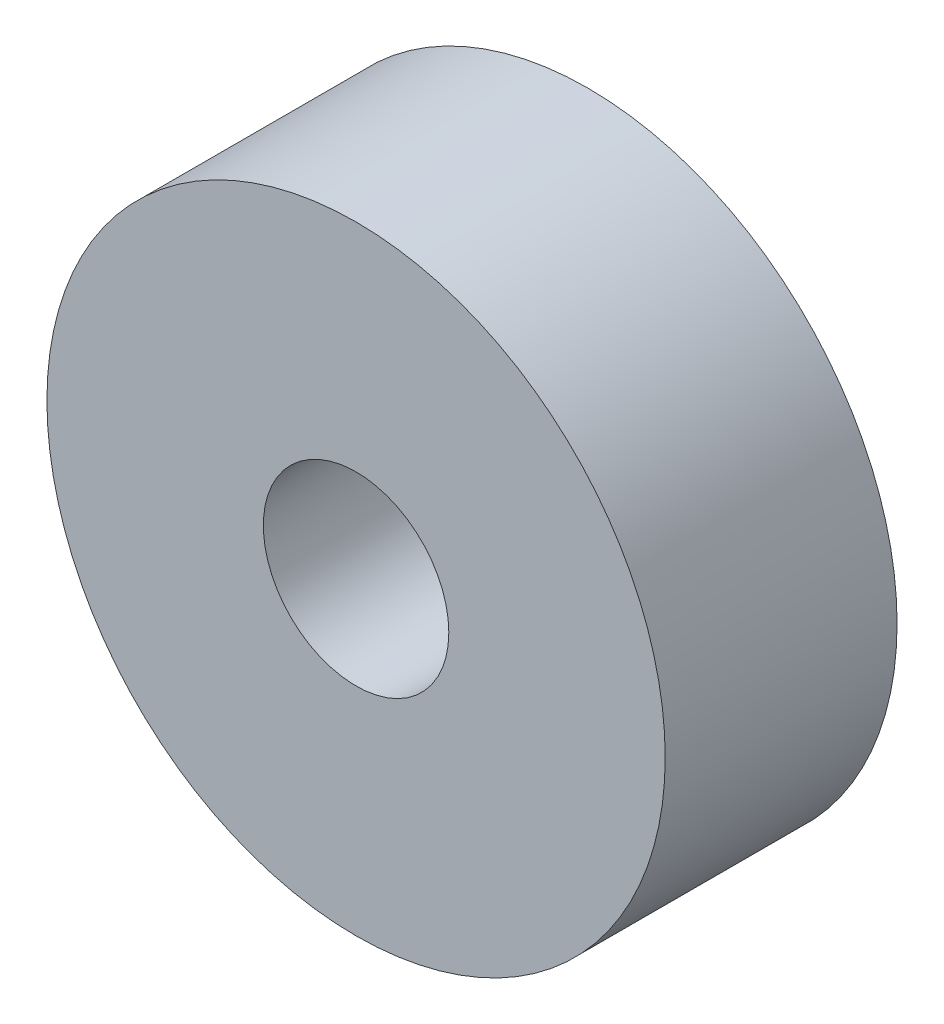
ISO-10303-21;
HEADER;
FILE_DESCRIPTION(('STEP AP214'),'2;1');
FILE_NAME('part.step','',(''),(''),'','','');
FILE_SCHEMA(('AUTOMOTIVE_DESIGN { 1 0 10303 214 1 1 1 1 }'));
ENDSEC;
DATA;
#1=APPLICATION_CONTEXT('core data for automotive mechanical design processes');
#2=APPLICATION_PROTOCOL_DEFINITION('international standard','automotive_design',2000,#1);
#3=PRODUCT_CONTEXT('',#1,'mechanical');
#4=PRODUCT('Part','Part','',(#3));
#5=PRODUCT_RELATED_PRODUCT_CATEGORY('part','',(#4));
#6=PRODUCT_DEFINITION_FORMATION('','',#4);
#7=PRODUCT_DEFINITION_CONTEXT('part definition',#1,'design');
#8=PRODUCT_DEFINITION('design','',#6,#7);
#9=PRODUCT_DEFINITION_SHAPE('','',#8);
#10=(LENGTH_UNIT() NAMED_UNIT(*) SI_UNIT(.MILLI.,.METRE.));
#11=(NAMED_UNIT(*) PLANE_ANGLE_UNIT() SI_UNIT($,.RADIAN.));
#12=(NAMED_UNIT(*) SI_UNIT($,.STERADIAN.) SOLID_ANGLE_UNIT());
#13=UNCERTAINTY_MEASURE_WITH_UNIT(LENGTH_MEASURE(1.E-05),#10,'distance_accuracy_value','');
#14=(GEOMETRIC_REPRESENTATION_CONTEXT(3) GLOBAL_UNCERTAINTY_ASSIGNED_CONTEXT((#13)) GLOBAL_UNIT_ASSIGNED_CONTEXT((#10,
#11,#12)) REPRESENTATION_CONTEXT('',''));
#15=CARTESIAN_POINT('',(0.,0.,0.));
#16=DIRECTION('',(0.,0.,1.));
#17=DIRECTION('',(1.,0.,0.));
#18=AXIS2_PLACEMENT_3D('',#15,#16,#17);
#19=CARTESIAN_POINT('',(0.,0.,15.));
#20=DIRECTION('',(0.,0.,-1.));
#21=DIRECTION('',(-1.,0.,0.));
#22=AXIS2_PLACEMENT_3D('',#19,#20,#21);
#23=CYLINDRICAL_SURFACE('',#22,6.);
#24=CARTESIAN_POINT('',(0.,0.,15.));
#25=DIRECTION('',(0.,0.,1.));
#26=DIRECTION('',(1.,0.,0.));
#27=AXIS2_PLACEMENT_3D('',#24,#25,#26);
#28=CIRCLE('',#27,6.);
#29=CARTESIAN_POINT('',(6.,0.,15.));
#30=VERTEX_POINT('',#29);
#31=EDGE_CURVE('E37',#30,#30,#28,.T.);
#32=ORIENTED_EDGE('',*,*,#31,.T.);
#33=EDGE_LOOP('',(#32));
#34=FACE_BOUND('',#33,.T.);
#35=CARTESIAN_POINT('',(0.,0.,0.));
#36=DIRECTION('',(0.,0.,1.));
#37=DIRECTION('',(1.,0.,0.));
#38=AXIS2_PLACEMENT_3D('',#35,#36,#37);
#39=CIRCLE('',#38,6.);
#40=CARTESIAN_POINT('',(6.,0.,0.));
#41=VERTEX_POINT('',#40);
#42=EDGE_CURVE('E43',#41,#41,#39,.T.);
#43=ORIENTED_EDGE('',*,*,#42,.F.);
#44=EDGE_LOOP('',(#43));
#45=FACE_BOUND('',#44,.T.);
#46=ADVANCED_FACE('F30',(#34,#45),#23,.F.);
#47=CARTESIAN_POINT('',(0.,0.,15.));
#48=DIRECTION('',(0.,0.,-1.));
#49=DIRECTION('',(-1.,0.,0.));
#50=AXIS2_PLACEMENT_3D('',#47,#48,#49);
#51=CYLINDRICAL_SURFACE('',#50,20.);
#52=CARTESIAN_POINT('',(0.,0.,15.));
#53=DIRECTION('',(0.,0.,1.));
#54=DIRECTION('',(1.,0.,0.));
#55=AXIS2_PLACEMENT_3D('',#52,#53,#54);
#56=CIRCLE('',#55,20.);
#57=CARTESIAN_POINT('',(20.,0.,15.));
#58=VERTEX_POINT('',#57);
#59=EDGE_CURVE('E10',#58,#58,#56,.T.);
#60=ORIENTED_EDGE('',*,*,#59,.F.);
#61=EDGE_LOOP('',(#60));
#62=FACE_BOUND('',#61,.T.);
#63=CARTESIAN_POINT('',(0.,0.,0.));
#64=DIRECTION('',(0.,0.,1.));
#65=DIRECTION('',(1.,0.,0.));
#66=AXIS2_PLACEMENT_3D('',#63,#64,#65);
#67=CIRCLE('',#66,20.);
#68=CARTESIAN_POINT('',(20.,0.,0.));
#69=VERTEX_POINT('',#68);
#70=EDGE_CURVE('E33',#69,#69,#67,.T.);
#71=ORIENTED_EDGE('',*,*,#70,.T.);
#72=EDGE_LOOP('',(#71));
#73=FACE_BOUND('',#72,.T.);
#74=ADVANCED_FACE('F50',(#62,#73),#51,.T.);
#75=CARTESIAN_POINT('',(0.,0.,15.));
#76=DIRECTION('',(0.,0.,1.));
#77=DIRECTION('',(1.,0.,0.));
#78=AXIS2_PLACEMENT_3D('',#75,#76,#77);
#79=PLANE('',#78);
#80=ORIENTED_EDGE('',*,*,#31,.F.);
#81=EDGE_LOOP('',(#80));
#82=FACE_BOUND('',#81,.T.);
#83=ORIENTED_EDGE('',*,*,#59,.T.);
#84=EDGE_LOOP('',(#83));
#85=FACE_BOUND('',#84,.T.);
#86=ADVANCED_FACE('F54',(#82,#85),#79,.T.);
#87=CARTESIAN_POINT('',(0.,0.,0.));
#88=DIRECTION('',(0.,0.,1.));
#89=DIRECTION('',(1.,0.,0.));
#90=AXIS2_PLACEMENT_3D('',#87,#88,#89);
#91=PLANE('',#90);
#92=ORIENTED_EDGE('',*,*,#42,.T.);
#93=EDGE_LOOP('',(#92));
#94=FACE_BOUND('',#93,.T.);
#95=ORIENTED_EDGE('',*,*,#70,.F.);
#96=EDGE_LOOP('',(#95));
#97=FACE_BOUND('',#96,.T.);
#98=ADVANCED_FACE('F52',(#94,#97),#91,.F.);
#99=CLOSED_SHELL('',(#46,#74,#86,#98));
#100=MANIFOLD_SOLID_BREP('B2',#99);
#101=ADVANCED_BREP_SHAPE_REPRESENTATION('',(#18,#100),#14);
#102=SHAPE_DEFINITION_REPRESENTATION(#9,#101);
ENDSEC;
END-ISO-10303-21;
